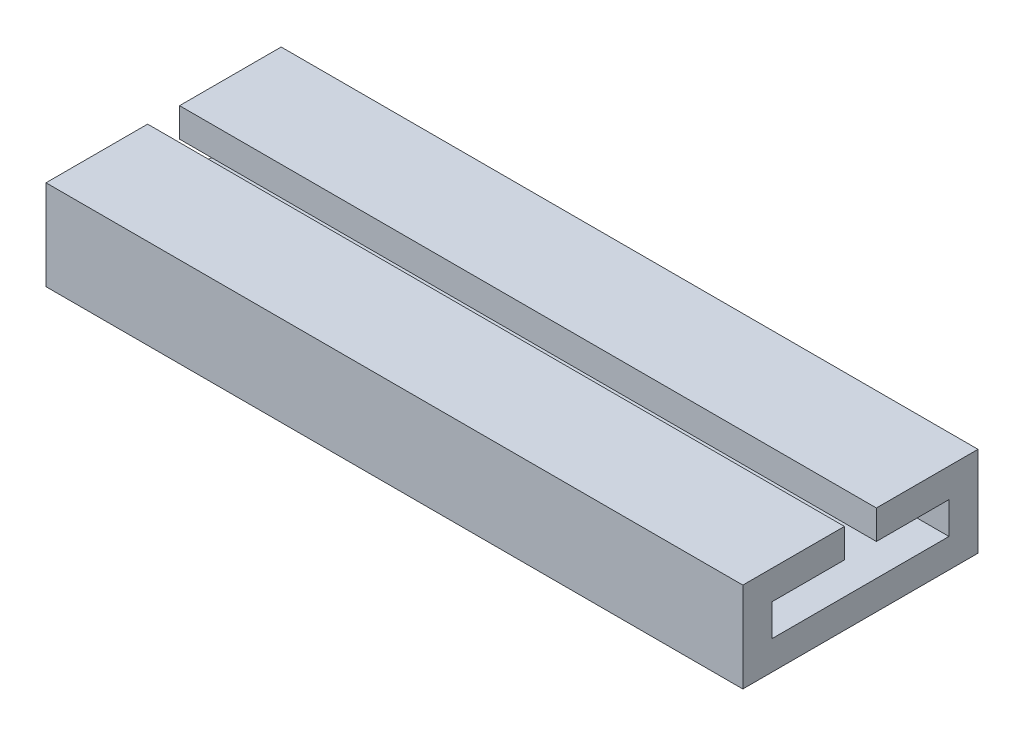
ISO-10303-21;
HEADER;
FILE_DESCRIPTION(('STEP AP214'),'2;1');
FILE_NAME('part.step','',(''),(''),'','','');
FILE_SCHEMA(('AUTOMOTIVE_DESIGN { 1 0 10303 214 1 1 1 1 }'));
ENDSEC;
DATA;
#1=APPLICATION_CONTEXT('core data for automotive mechanical design processes');
#2=APPLICATION_PROTOCOL_DEFINITION('international standard','automotive_design',2000,#1);
#3=PRODUCT_CONTEXT('',#1,'mechanical');
#4=PRODUCT('Part','Part','',(#3));
#5=PRODUCT_RELATED_PRODUCT_CATEGORY('part','',(#4));
#6=PRODUCT_DEFINITION_FORMATION('','',#4);
#7=PRODUCT_DEFINITION_CONTEXT('part definition',#1,'design');
#8=PRODUCT_DEFINITION('design','',#6,#7);
#9=PRODUCT_DEFINITION_SHAPE('','',#8);
#10=(LENGTH_UNIT() NAMED_UNIT(*) SI_UNIT(.MILLI.,.METRE.));
#11=(NAMED_UNIT(*) PLANE_ANGLE_UNIT() SI_UNIT($,.RADIAN.));
#12=(NAMED_UNIT(*) SI_UNIT($,.STERADIAN.) SOLID_ANGLE_UNIT());
#13=UNCERTAINTY_MEASURE_WITH_UNIT(LENGTH_MEASURE(1.E-05),#10,'distance_accuracy_value','');
#14=(GEOMETRIC_REPRESENTATION_CONTEXT(3) GLOBAL_UNCERTAINTY_ASSIGNED_CONTEXT((#13)) GLOBAL_UNIT_ASSIGNED_CONTEXT((#10,
#11,#12)) REPRESENTATION_CONTEXT('',''));
#15=CARTESIAN_POINT('',(0.,0.,0.));
#16=DIRECTION('',(0.,0.,1.));
#17=DIRECTION('',(1.,0.,0.));
#18=AXIS2_PLACEMENT_3D('',#15,#16,#17);
#19=CARTESIAN_POINT('',(120.,7.75000000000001,20.25));
#20=DIRECTION('',(0.,1.,0.));
#21=DIRECTION('',(0.,0.,1.));
#22=AXIS2_PLACEMENT_3D('',#19,#20,#21);
#23=PLANE('',#22);
#24=DIRECTION('',(0.,0.,-1.));
#25=VECTOR('',#24,1.);
#26=CARTESIAN_POINT('',(120.,7.75000000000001,20.25));
#27=LINE('',#26,#25);
#28=CARTESIAN_POINT('',(120.,7.75000000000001,20.25));
#29=VERTEX_POINT('',#28);
#30=CARTESIAN_POINT('',(120.,7.75000000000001,2.75));
#31=VERTEX_POINT('',#30);
#32=EDGE_CURVE('E279',#29,#31,#27,.T.);
#33=ORIENTED_EDGE('',*,*,#32,.T.);
#34=DIRECTION('',(-1.,0.,0.));
#35=VECTOR('',#34,1.);
#36=CARTESIAN_POINT('',(120.,7.75000000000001,2.75));
#37=LINE('',#36,#35);
#38=CARTESIAN_POINT('',(0.,7.75000000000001,2.75));
#39=VERTEX_POINT('',#38);
#40=EDGE_CURVE('E227',#31,#39,#37,.T.);
#41=ORIENTED_EDGE('',*,*,#40,.T.);
#42=DIRECTION('',(0.,0.,-1.));
#43=VECTOR('',#42,1.);
#44=CARTESIAN_POINT('',(0.,7.75000000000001,20.25));
#45=LINE('',#44,#43);
#46=CARTESIAN_POINT('',(0.,7.75000000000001,20.25));
#47=VERTEX_POINT('',#46);
#48=EDGE_CURVE('E295',#47,#39,#45,.T.);
#49=ORIENTED_EDGE('',*,*,#48,.F.);
#50=DIRECTION('',(-1.,0.,0.));
#51=VECTOR('',#50,1.);
#52=CARTESIAN_POINT('',(120.,7.75000000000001,20.25));
#53=LINE('',#52,#51);
#54=EDGE_CURVE('E11',#29,#47,#53,.T.);
#55=ORIENTED_EDGE('',*,*,#54,.F.);
#56=EDGE_LOOP('',(#33,#41,#49,#55));
#57=FACE_BOUND('',#56,.T.);
#58=ADVANCED_FACE('F42',(#57),#23,.T.);
#59=CARTESIAN_POINT('',(0.,2.75,-15.25));
#60=DIRECTION('',(0.,1.,0.));
#61=DIRECTION('',(0.,0.,1.));
#62=AXIS2_PLACEMENT_3D('',#59,#60,#61);
#63=PLANE('',#62);
#64=DIRECTION('',(-1.,0.,0.));
#65=VECTOR('',#64,1.);
#66=CARTESIAN_POINT('',(120.,2.75,2.75));
#67=LINE('',#66,#65);
#68=CARTESIAN_POINT('',(120.,2.75,2.74999999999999));
#69=VERTEX_POINT('',#68);
#70=CARTESIAN_POINT('',(0.,2.75,2.75));
#71=VERTEX_POINT('',#70);
#72=EDGE_CURVE('E213',#69,#71,#67,.T.);
#73=ORIENTED_EDGE('',*,*,#72,.F.);
#74=DIRECTION('',(0.,0.,1.));
#75=VECTOR('',#74,1.);
#76=CARTESIAN_POINT('',(120.,2.75,-15.25));
#77=LINE('',#76,#75);
#78=CARTESIAN_POINT('',(120.,2.75,15.25));
#79=VERTEX_POINT('',#78);
#80=EDGE_CURVE('E257',#69,#79,#77,.T.);
#81=ORIENTED_EDGE('',*,*,#80,.T.);
#82=DIRECTION('',(1.,0.,0.));
#83=VECTOR('',#82,1.);
#84=CARTESIAN_POINT('',(0.,2.75,15.25));
#85=LINE('',#84,#83);
#86=CARTESIAN_POINT('',(0.,2.75,15.25));
#87=VERTEX_POINT('',#86);
#88=EDGE_CURVE('E271',#87,#79,#85,.T.);
#89=ORIENTED_EDGE('',*,*,#88,.F.);
#90=DIRECTION('',(0.,0.,1.));
#91=VECTOR('',#90,1.);
#92=CARTESIAN_POINT('',(0.,2.75,-15.25));
#93=LINE('',#92,#91);
#94=EDGE_CURVE('E241',#71,#87,#93,.T.);
#95=ORIENTED_EDGE('',*,*,#94,.F.);
#96=EDGE_LOOP('',(#73,#81,#89,#95));
#97=FACE_BOUND('',#96,.T.);
#98=ADVANCED_FACE('F338',(#97),#63,.F.);
#99=CARTESIAN_POINT('',(120.,0.,0.));
#100=DIRECTION('',(1.,0.,0.));
#101=DIRECTION('',(0.,0.,-1.));
#102=AXIS2_PLACEMENT_3D('',#99,#100,#101);
#103=PLANE('',#102);
#104=DIRECTION('',(0.,-1.,0.));
#105=VECTOR('',#104,1.);
#106=CARTESIAN_POINT('',(120.,7.75000000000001,-2.75));
#107=LINE('',#106,#105);
#108=CARTESIAN_POINT('',(120.,7.75000000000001,-2.75));
#109=VERTEX_POINT('',#108);
#110=CARTESIAN_POINT('',(120.,2.75,-2.75));
#111=VERTEX_POINT('',#110);
#112=EDGE_CURVE('E208',#109,#111,#107,.T.);
#113=ORIENTED_EDGE('',*,*,#112,.T.);
#114=CARTESIAN_POINT('',(120.,2.75,-15.25));
#115=VERTEX_POINT('',#114);
#116=EDGE_CURVE('E258',#115,#111,#77,.T.);
#117=ORIENTED_EDGE('',*,*,#116,.F.);
#118=DIRECTION('',(0.,-1.,0.));
#119=VECTOR('',#118,1.);
#120=CARTESIAN_POINT('',(120.,2.75,-15.25));
#121=LINE('',#120,#119);
#122=CARTESIAN_POINT('',(120.,-2.75,-15.25));
#123=VERTEX_POINT('',#122);
#124=EDGE_CURVE('E237',#115,#123,#121,.T.);
#125=ORIENTED_EDGE('',*,*,#124,.T.);
#126=DIRECTION('',(0.,0.,1.));
#127=VECTOR('',#126,1.);
#128=CARTESIAN_POINT('',(120.,-2.75,-15.25));
#129=LINE('',#128,#127);
#130=CARTESIAN_POINT('',(120.,-2.75,15.25));
#131=VERTEX_POINT('',#130);
#132=EDGE_CURVE('E223',#123,#131,#129,.T.);
#133=ORIENTED_EDGE('',*,*,#132,.T.);
#134=DIRECTION('',(0.,-1.,0.));
#135=VECTOR('',#134,1.);
#136=CARTESIAN_POINT('',(120.,2.75,15.25));
#137=LINE('',#136,#135);
#138=EDGE_CURVE('E253',#79,#131,#137,.T.);
#139=ORIENTED_EDGE('',*,*,#138,.F.);
#140=ORIENTED_EDGE('',*,*,#80,.F.);
#141=DIRECTION('',(0.,-1.,0.));
#142=VECTOR('',#141,1.);
#143=CARTESIAN_POINT('',(120.,7.75000000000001,2.75));
#144=LINE('',#143,#142);
#145=EDGE_CURVE('E205',#31,#69,#144,.T.);
#146=ORIENTED_EDGE('',*,*,#145,.F.);
#147=ORIENTED_EDGE('',*,*,#32,.F.);
#148=DIRECTION('',(0.,1.,0.));
#149=VECTOR('',#148,1.);
#150=CARTESIAN_POINT('',(120.,-7.75,20.25));
#151=LINE('',#150,#149);
#152=CARTESIAN_POINT('',(120.,-7.75,20.25));
#153=VERTEX_POINT('',#152);
#154=EDGE_CURVE('E291',#153,#29,#151,.T.);
#155=ORIENTED_EDGE('',*,*,#154,.F.);
#156=DIRECTION('',(0.,0.,-1.));
#157=VECTOR('',#156,1.);
#158=CARTESIAN_POINT('',(120.,-7.75,20.25));
#159=LINE('',#158,#157);
#160=CARTESIAN_POINT('',(120.,-7.75,-20.25));
#161=VERTEX_POINT('',#160);
#162=EDGE_CURVE('E288',#153,#161,#159,.T.);
#163=ORIENTED_EDGE('',*,*,#162,.T.);
#164=DIRECTION('',(0.,1.,0.));
#165=VECTOR('',#164,1.);
#166=CARTESIAN_POINT('',(120.,-7.75,-20.25));
#167=LINE('',#166,#165);
#168=CARTESIAN_POINT('',(120.,7.75000000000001,-20.25));
#169=VERTEX_POINT('',#168);
#170=EDGE_CURVE('E283',#161,#169,#167,.T.);
#171=ORIENTED_EDGE('',*,*,#170,.T.);
#172=EDGE_CURVE('E284',#109,#169,#27,.T.);
#173=ORIENTED_EDGE('',*,*,#172,.F.);
#174=EDGE_LOOP('',(#113,#117,#125,#133,#139,#140,#146,#147,#155,#163,#171,#173));
#175=FACE_BOUND('',#174,.T.);
#176=ADVANCED_FACE('F347',(#175),#103,.T.);
#177=CARTESIAN_POINT('',(0.,0.,0.));
#178=DIRECTION('',(1.,0.,0.));
#179=DIRECTION('',(0.,0.,-1.));
#180=AXIS2_PLACEMENT_3D('',#177,#178,#179);
#181=PLANE('',#180);
#182=CARTESIAN_POINT('',(0.,2.75,-15.25));
#183=VERTEX_POINT('',#182);
#184=CARTESIAN_POINT('',(0.,2.75,-2.75000000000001));
#185=VERTEX_POINT('',#184);
#186=EDGE_CURVE('E242',#183,#185,#93,.T.);
#187=ORIENTED_EDGE('',*,*,#186,.T.);
#188=DIRECTION('',(0.,-1.,0.));
#189=VECTOR('',#188,1.);
#190=CARTESIAN_POINT('',(0.,7.75000000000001,-2.75));
#191=LINE('',#190,#189);
#192=CARTESIAN_POINT('',(0.,7.75000000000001,-2.75));
#193=VERTEX_POINT('',#192);
#194=EDGE_CURVE('E209',#193,#185,#191,.T.);
#195=ORIENTED_EDGE('',*,*,#194,.F.);
#196=CARTESIAN_POINT('',(0.,7.75000000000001,-20.25));
#197=VERTEX_POINT('',#196);
#198=EDGE_CURVE('E278',#193,#197,#45,.T.);
#199=ORIENTED_EDGE('',*,*,#198,.T.);
#200=DIRECTION('',(0.,1.,0.));
#201=VECTOR('',#200,1.);
#202=CARTESIAN_POINT('',(0.,-7.75,-20.25));
#203=LINE('',#202,#201);
#204=CARTESIAN_POINT('',(0.,-7.75,-20.25));
#205=VERTEX_POINT('',#204);
#206=EDGE_CURVE('E299',#205,#197,#203,.T.);
#207=ORIENTED_EDGE('',*,*,#206,.F.);
#208=DIRECTION('',(0.,0.,-1.));
#209=VECTOR('',#208,1.);
#210=CARTESIAN_POINT('',(0.,-7.75,20.25));
#211=LINE('',#210,#209);
#212=CARTESIAN_POINT('',(0.,-7.75,20.25));
#213=VERTEX_POINT('',#212);
#214=EDGE_CURVE('E303',#213,#205,#211,.T.);
#215=ORIENTED_EDGE('',*,*,#214,.F.);
#216=DIRECTION('',(0.,1.,0.));
#217=VECTOR('',#216,1.);
#218=CARTESIAN_POINT('',(0.,-7.75,20.25));
#219=LINE('',#218,#217);
#220=EDGE_CURVE('E306',#213,#47,#219,.T.);
#221=ORIENTED_EDGE('',*,*,#220,.T.);
#222=ORIENTED_EDGE('',*,*,#48,.T.);
#223=DIRECTION('',(0.,-1.,0.));
#224=VECTOR('',#223,1.);
#225=CARTESIAN_POINT('',(0.,7.75000000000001,2.75));
#226=LINE('',#225,#224);
#227=EDGE_CURVE('E199',#39,#71,#226,.T.);
#228=ORIENTED_EDGE('',*,*,#227,.T.);
#229=ORIENTED_EDGE('',*,*,#94,.T.);
#230=DIRECTION('',(0.,-1.,0.));
#231=VECTOR('',#230,1.);
#232=CARTESIAN_POINT('',(0.,2.75,15.25));
#233=LINE('',#232,#231);
#234=CARTESIAN_POINT('',(0.,-2.75,15.25));
#235=VERTEX_POINT('',#234);
#236=EDGE_CURVE('E236',#87,#235,#233,.T.);
#237=ORIENTED_EDGE('',*,*,#236,.T.);
#238=DIRECTION('',(0.,0.,1.));
#239=VECTOR('',#238,1.);
#240=CARTESIAN_POINT('',(0.,-2.75,-15.25));
#241=LINE('',#240,#239);
#242=CARTESIAN_POINT('',(0.,-2.75,-15.25));
#243=VERTEX_POINT('',#242);
#244=EDGE_CURVE('E233',#243,#235,#241,.T.);
#245=ORIENTED_EDGE('',*,*,#244,.F.);
#246=DIRECTION('',(0.,-1.,0.));
#247=VECTOR('',#246,1.);
#248=CARTESIAN_POINT('',(0.,2.75,-15.25));
#249=LINE('',#248,#247);
#250=EDGE_CURVE('E246',#183,#243,#249,.T.);
#251=ORIENTED_EDGE('',*,*,#250,.F.);
#252=EDGE_LOOP('',(#187,#195,#199,#207,#215,#221,#222,#228,#229,#237,#245,#251));
#253=FACE_BOUND('',#252,.T.);
#254=ADVANCED_FACE('F328',(#253),#181,.F.);
#255=DIRECTION('',(-1.,0.,0.));
#256=VECTOR('',#255,1.);
#257=CARTESIAN_POINT('',(120.,7.75000000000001,-2.75));
#258=LINE('',#257,#256);
#259=EDGE_CURVE('E224',#109,#193,#258,.T.);
#260=ORIENTED_EDGE('',*,*,#259,.F.);
#261=ORIENTED_EDGE('',*,*,#172,.T.);
#262=DIRECTION('',(-1.,0.,0.));
#263=VECTOR('',#262,1.);
#264=CARTESIAN_POINT('',(120.,7.75000000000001,-20.25));
#265=LINE('',#264,#263);
#266=EDGE_CURVE('E46',#169,#197,#265,.T.);
#267=ORIENTED_EDGE('',*,*,#266,.T.);
#268=ORIENTED_EDGE('',*,*,#198,.F.);
#269=EDGE_LOOP('',(#260,#261,#267,#268));
#270=FACE_BOUND('',#269,.T.);
#271=ADVANCED_FACE('F44',(#270),#23,.T.);
#272=CARTESIAN_POINT('',(120.,-7.75,20.25));
#273=DIRECTION('',(0.,0.,1.));
#274=DIRECTION('',(1.,0.,0.));
#275=AXIS2_PLACEMENT_3D('',#272,#273,#274);
#276=PLANE('',#275);
#277=ORIENTED_EDGE('',*,*,#220,.F.);
#278=DIRECTION('',(-1.,0.,0.));
#279=VECTOR('',#278,1.);
#280=CARTESIAN_POINT('',(120.,-7.75,20.25));
#281=LINE('',#280,#279);
#282=EDGE_CURVE('E52',#153,#213,#281,.T.);
#283=ORIENTED_EDGE('',*,*,#282,.F.);
#284=ORIENTED_EDGE('',*,*,#154,.T.);
#285=ORIENTED_EDGE('',*,*,#54,.T.);
#286=EDGE_LOOP('',(#277,#283,#284,#285));
#287=FACE_BOUND('',#286,.T.);
#288=ADVANCED_FACE('F365',(#287),#276,.T.);
#289=CARTESIAN_POINT('',(120.,-7.75,20.25));
#290=DIRECTION('',(0.,1.,0.));
#291=DIRECTION('',(0.,0.,1.));
#292=AXIS2_PLACEMENT_3D('',#289,#290,#291);
#293=PLANE('',#292);
#294=DIRECTION('',(0.,0.,1.));
#295=VECTOR('',#294,1.);
#296=CARTESIAN_POINT('',(9.99999999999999,-7.75,-2.75));
#297=LINE('',#296,#295);
#298=CARTESIAN_POINT('',(9.99999999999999,-7.75,-2.75));
#299=VERTEX_POINT('',#298);
#300=CARTESIAN_POINT('',(10.,-7.75,2.75));
#301=VERTEX_POINT('',#300);
#302=EDGE_CURVE('E171',#299,#301,#297,.T.);
#303=ORIENTED_EDGE('',*,*,#302,.T.);
#304=DIRECTION('',(1.,0.,0.));
#305=VECTOR('',#304,1.);
#306=CARTESIAN_POINT('',(10.,-7.75,2.75));
#307=LINE('',#306,#305);
#308=CARTESIAN_POINT('',(110.,-7.75,2.75));
#309=VERTEX_POINT('',#308);
#310=EDGE_CURVE('E165',#301,#309,#307,.T.);
#311=ORIENTED_EDGE('',*,*,#310,.T.);
#312=DIRECTION('',(0.,0.,1.));
#313=VECTOR('',#312,1.);
#314=CARTESIAN_POINT('',(110.,-7.75,-2.75));
#315=LINE('',#314,#313);
#316=CARTESIAN_POINT('',(110.,-7.75,-2.75));
#317=VERTEX_POINT('',#316);
#318=EDGE_CURVE('E156',#317,#309,#315,.T.);
#319=ORIENTED_EDGE('',*,*,#318,.F.);
#320=DIRECTION('',(1.,0.,0.));
#321=VECTOR('',#320,1.);
#322=CARTESIAN_POINT('',(9.99999999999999,-7.75,-2.75));
#323=LINE('',#322,#321);
#324=EDGE_CURVE('E164',#299,#317,#323,.T.);
#325=ORIENTED_EDGE('',*,*,#324,.F.);
#326=EDGE_LOOP('',(#303,#311,#319,#325));
#327=FACE_BOUND('',#326,.T.);
#328=ORIENTED_EDGE('',*,*,#214,.T.);
#329=DIRECTION('',(-1.,0.,0.));
#330=VECTOR('',#329,1.);
#331=CARTESIAN_POINT('',(120.,-7.75,-20.25));
#332=LINE('',#331,#330);
#333=EDGE_CURVE('E311',#161,#205,#332,.T.);
#334=ORIENTED_EDGE('',*,*,#333,.F.);
#335=ORIENTED_EDGE('',*,*,#162,.F.);
#336=ORIENTED_EDGE('',*,*,#282,.T.);
#337=EDGE_LOOP('',(#328,#334,#335,#336));
#338=FACE_BOUND('',#337,.T.);
#339=ADVANCED_FACE('F173',(#327,#338),#293,.F.);
#340=CARTESIAN_POINT('',(120.,-7.75,-20.25));
#341=DIRECTION('',(0.,0.,1.));
#342=DIRECTION('',(1.,0.,0.));
#343=AXIS2_PLACEMENT_3D('',#340,#341,#342);
#344=PLANE('',#343);
#345=ORIENTED_EDGE('',*,*,#206,.T.);
#346=ORIENTED_EDGE('',*,*,#266,.F.);
#347=ORIENTED_EDGE('',*,*,#170,.F.);
#348=ORIENTED_EDGE('',*,*,#333,.T.);
#349=EDGE_LOOP('',(#345,#346,#347,#348));
#350=FACE_BOUND('',#349,.T.);
#351=ADVANCED_FACE('F325',(#350),#344,.F.);
#352=CARTESIAN_POINT('',(0.,-2.75,-15.25));
#353=DIRECTION('',(0.,1.,0.));
#354=DIRECTION('',(0.,0.,1.));
#355=AXIS2_PLACEMENT_3D('',#352,#353,#354);
#356=PLANE('',#355);
#357=DIRECTION('',(1.,0.,0.));
#358=VECTOR('',#357,1.);
#359=CARTESIAN_POINT('',(10.,-2.75,2.75));
#360=LINE('',#359,#358);
#361=CARTESIAN_POINT('',(10.,-2.75,2.75));
#362=VERTEX_POINT('',#361);
#363=CARTESIAN_POINT('',(110.,-2.75,2.75));
#364=VERTEX_POINT('',#363);
#365=EDGE_CURVE('E68',#362,#364,#360,.T.);
#366=ORIENTED_EDGE('',*,*,#365,.F.);
#367=DIRECTION('',(0.,0.,1.));
#368=VECTOR('',#367,1.);
#369=CARTESIAN_POINT('',(9.99999999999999,-2.75,-2.75));
#370=LINE('',#369,#368);
#371=CARTESIAN_POINT('',(9.99999999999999,-2.75,-2.75));
#372=VERTEX_POINT('',#371);
#373=EDGE_CURVE('E177',#372,#362,#370,.T.);
#374=ORIENTED_EDGE('',*,*,#373,.F.);
#375=DIRECTION('',(1.,0.,0.));
#376=VECTOR('',#375,1.);
#377=CARTESIAN_POINT('',(9.99999999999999,-2.75,-2.75));
#378=LINE('',#377,#376);
#379=CARTESIAN_POINT('',(110.,-2.75,-2.75));
#380=VERTEX_POINT('',#379);
#381=EDGE_CURVE('E181',#372,#380,#378,.T.);
#382=ORIENTED_EDGE('',*,*,#381,.T.);
#383=DIRECTION('',(0.,0.,1.));
#384=VECTOR('',#383,1.);
#385=CARTESIAN_POINT('',(110.,-2.75,-2.75));
#386=LINE('',#385,#384);
#387=EDGE_CURVE('E190',#380,#364,#386,.T.);
#388=ORIENTED_EDGE('',*,*,#387,.T.);
#389=EDGE_LOOP('',(#366,#374,#382,#388));
#390=FACE_BOUND('',#389,.T.);
#391=ORIENTED_EDGE('',*,*,#132,.F.);
#392=DIRECTION('',(1.,0.,0.));
#393=VECTOR('',#392,1.);
#394=CARTESIAN_POINT('',(0.,-2.75,-15.25));
#395=LINE('',#394,#393);
#396=EDGE_CURVE('E249',#243,#123,#395,.T.);
#397=ORIENTED_EDGE('',*,*,#396,.F.);
#398=ORIENTED_EDGE('',*,*,#244,.T.);
#399=DIRECTION('',(1.,0.,0.));
#400=VECTOR('',#399,1.);
#401=CARTESIAN_POINT('',(0.,-2.75,15.25));
#402=LINE('',#401,#400);
#403=EDGE_CURVE('E275',#235,#131,#402,.T.);
#404=ORIENTED_EDGE('',*,*,#403,.T.);
#405=EDGE_LOOP('',(#391,#397,#398,#404));
#406=FACE_BOUND('',#405,.T.);
#407=ADVANCED_FACE('F352',(#390,#406),#356,.T.);
#408=CARTESIAN_POINT('',(0.,2.75,15.25));
#409=DIRECTION('',(0.,0.,1.));
#410=DIRECTION('',(1.,0.,0.));
#411=AXIS2_PLACEMENT_3D('',#408,#409,#410);
#412=PLANE('',#411);
#413=ORIENTED_EDGE('',*,*,#138,.T.);
#414=ORIENTED_EDGE('',*,*,#403,.F.);
#415=ORIENTED_EDGE('',*,*,#236,.F.);
#416=ORIENTED_EDGE('',*,*,#88,.T.);
#417=EDGE_LOOP('',(#413,#414,#415,#416));
#418=FACE_BOUND('',#417,.T.);
#419=ADVANCED_FACE('F345',(#418),#412,.F.);
#420=ORIENTED_EDGE('',*,*,#116,.T.);
#421=DIRECTION('',(-1.,0.,0.));
#422=VECTOR('',#421,1.);
#423=CARTESIAN_POINT('',(120.,2.75,-2.75));
#424=LINE('',#423,#422);
#425=EDGE_CURVE('E219',#111,#185,#424,.T.);
#426=ORIENTED_EDGE('',*,*,#425,.T.);
#427=ORIENTED_EDGE('',*,*,#186,.F.);
#428=DIRECTION('',(1.,0.,0.));
#429=VECTOR('',#428,1.);
#430=CARTESIAN_POINT('',(0.,2.75,-15.25));
#431=LINE('',#430,#429);
#432=EDGE_CURVE('E268',#183,#115,#431,.T.);
#433=ORIENTED_EDGE('',*,*,#432,.T.);
#434=EDGE_LOOP('',(#420,#426,#427,#433));
#435=FACE_BOUND('',#434,.T.);
#436=ADVANCED_FACE('F370',(#435),#63,.F.);
#437=CARTESIAN_POINT('',(0.,2.75,-15.25));
#438=DIRECTION('',(0.,0.,1.));
#439=DIRECTION('',(1.,0.,0.));
#440=AXIS2_PLACEMENT_3D('',#437,#438,#439);
#441=PLANE('',#440);
#442=ORIENTED_EDGE('',*,*,#124,.F.);
#443=ORIENTED_EDGE('',*,*,#432,.F.);
#444=ORIENTED_EDGE('',*,*,#250,.T.);
#445=ORIENTED_EDGE('',*,*,#396,.T.);
#446=EDGE_LOOP('',(#442,#443,#444,#445));
#447=FACE_BOUND('',#446,.T.);
#448=ADVANCED_FACE('F355',(#447),#441,.T.);
#449=CARTESIAN_POINT('',(120.,7.75000000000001,2.75));
#450=DIRECTION('',(0.,0.,-1.));
#451=DIRECTION('',(-1.,0.,0.));
#452=AXIS2_PLACEMENT_3D('',#449,#450,#451);
#453=PLANE('',#452);
#454=ORIENTED_EDGE('',*,*,#227,.F.);
#455=ORIENTED_EDGE('',*,*,#40,.F.);
#456=ORIENTED_EDGE('',*,*,#145,.T.);
#457=ORIENTED_EDGE('',*,*,#72,.T.);
#458=EDGE_LOOP('',(#454,#455,#456,#457));
#459=FACE_BOUND('',#458,.T.);
#460=ADVANCED_FACE('F360',(#459),#453,.T.);
#461=CARTESIAN_POINT('',(120.,7.75000000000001,-2.75));
#462=DIRECTION('',(0.,0.,-1.));
#463=DIRECTION('',(-1.,0.,0.));
#464=AXIS2_PLACEMENT_3D('',#461,#462,#463);
#465=PLANE('',#464);
#466=ORIENTED_EDGE('',*,*,#194,.T.);
#467=ORIENTED_EDGE('',*,*,#425,.F.);
#468=ORIENTED_EDGE('',*,*,#112,.F.);
#469=ORIENTED_EDGE('',*,*,#259,.T.);
#470=EDGE_LOOP('',(#466,#467,#468,#469));
#471=FACE_BOUND('',#470,.T.);
#472=ADVANCED_FACE('F371',(#471),#465,.F.);
#473=CARTESIAN_POINT('',(10.,-7.75,2.75));
#474=DIRECTION('',(0.,0.,1.));
#475=DIRECTION('',(1.,0.,0.));
#476=AXIS2_PLACEMENT_3D('',#473,#474,#475);
#477=PLANE('',#476);
#478=ORIENTED_EDGE('',*,*,#365,.T.);
#479=DIRECTION('',(0.,1.,0.));
#480=VECTOR('',#479,1.);
#481=CARTESIAN_POINT('',(110.,-7.75,2.75));
#482=LINE('',#481,#480);
#483=EDGE_CURVE('E158',#309,#364,#482,.T.);
#484=ORIENTED_EDGE('',*,*,#483,.F.);
#485=ORIENTED_EDGE('',*,*,#310,.F.);
#486=DIRECTION('',(0.,1.,0.));
#487=VECTOR('',#486,1.);
#488=CARTESIAN_POINT('',(10.,-7.75,2.75));
#489=LINE('',#488,#487);
#490=EDGE_CURVE('E196',#301,#362,#489,.T.);
#491=ORIENTED_EDGE('',*,*,#490,.T.);
#492=EDGE_LOOP('',(#478,#484,#485,#491));
#493=FACE_BOUND('',#492,.T.);
#494=ADVANCED_FACE('F168',(#493),#477,.F.);
#495=CARTESIAN_POINT('',(9.99999999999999,-7.75,-2.75));
#496=DIRECTION('',(-1.,0.,0.));
#497=DIRECTION('',(0.,0.,1.));
#498=AXIS2_PLACEMENT_3D('',#495,#496,#497);
#499=PLANE('',#498);
#500=ORIENTED_EDGE('',*,*,#373,.T.);
#501=ORIENTED_EDGE('',*,*,#490,.F.);
#502=ORIENTED_EDGE('',*,*,#302,.F.);
#503=DIRECTION('',(0.,1.,0.));
#504=VECTOR('',#503,1.);
#505=CARTESIAN_POINT('',(9.99999999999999,-7.75,-2.75));
#506=LINE('',#505,#504);
#507=EDGE_CURVE('E200',#299,#372,#506,.T.);
#508=ORIENTED_EDGE('',*,*,#507,.T.);
#509=EDGE_LOOP('',(#500,#501,#502,#508));
#510=FACE_BOUND('',#509,.T.);
#511=ADVANCED_FACE('F378',(#510),#499,.F.);
#512=CARTESIAN_POINT('',(9.99999999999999,-7.75,-2.75));
#513=DIRECTION('',(0.,0.,1.));
#514=DIRECTION('',(1.,0.,0.));
#515=AXIS2_PLACEMENT_3D('',#512,#513,#514);
#516=PLANE('',#515);
#517=ORIENTED_EDGE('',*,*,#381,.F.);
#518=ORIENTED_EDGE('',*,*,#507,.F.);
#519=ORIENTED_EDGE('',*,*,#324,.T.);
#520=DIRECTION('',(0.,1.,0.));
#521=VECTOR('',#520,1.);
#522=CARTESIAN_POINT('',(110.,-7.75,-2.75));
#523=LINE('',#522,#521);
#524=EDGE_CURVE('E60',#317,#380,#523,.T.);
#525=ORIENTED_EDGE('',*,*,#524,.T.);
#526=EDGE_LOOP('',(#517,#518,#519,#525));
#527=FACE_BOUND('',#526,.T.);
#528=ADVANCED_FACE('F513',(#527),#516,.T.);
#529=CARTESIAN_POINT('',(110.,-7.75,-2.75));
#530=DIRECTION('',(-1.,0.,0.));
#531=DIRECTION('',(0.,0.,1.));
#532=AXIS2_PLACEMENT_3D('',#529,#530,#531);
#533=PLANE('',#532);
#534=ORIENTED_EDGE('',*,*,#387,.F.);
#535=ORIENTED_EDGE('',*,*,#524,.F.);
#536=ORIENTED_EDGE('',*,*,#318,.T.);
#537=ORIENTED_EDGE('',*,*,#483,.T.);
#538=EDGE_LOOP('',(#534,#535,#536,#537));
#539=FACE_BOUND('',#538,.T.);
#540=ADVANCED_FACE('F157',(#539),#533,.T.);
#541=CLOSED_SHELL('',(#58,#98,#176,#254,#271,#288,#339,#351,#407,#419,#436,#448,#460,#472,#494,
#511,#528,#540));
#542=MANIFOLD_SOLID_BREP('B2',#541);
#543=ADVANCED_BREP_SHAPE_REPRESENTATION('',(#18,#542),#14);
#544=SHAPE_DEFINITION_REPRESENTATION(#9,#543);
ENDSEC;
END-ISO-10303-21;
